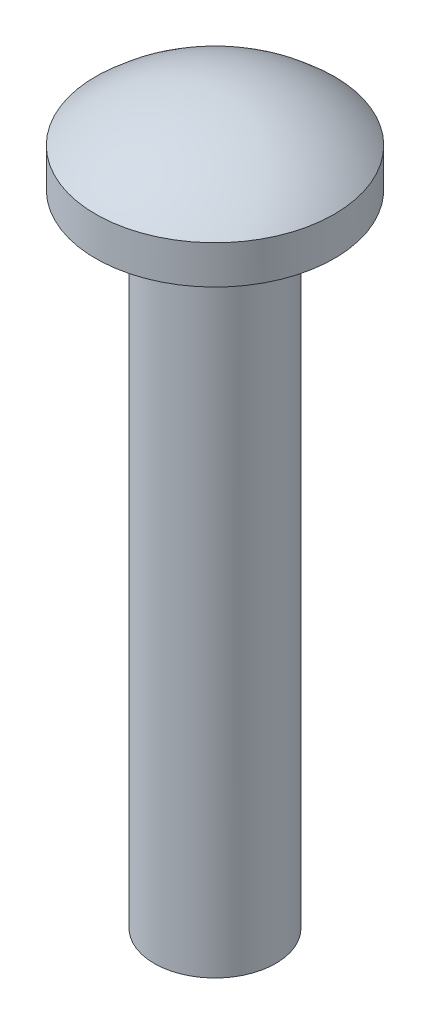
from build123d import *

# Parameters (mm, degrees)
SKETCH2_R           = 2.413
BOSS_EXTRUDE1_DEPTH = 25.4


with BuildPart() as part:
    # Sketch1 → Revolve1 (revolve)
    with BuildSketch(Plane.XY):
        with BuildLine():
            Line((0, 0), (0, 3.3782))
            ThreePointArc((0, 3.3782), (2.543529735, 2.898137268), (4.7371, 1.524))
            Line((4.7371, 1.524), (4.7371, 0))
            Line((4.7371, 0), (0, 0))
        make_face()
    revolve(axis=Axis((0, 0, 0), (0, 1, 0)))

    # Sketch2 → Boss-Extrude1 (add)
    with BuildSketch(Plane(origin=(0, 0, 0), x_dir=(1, 0, 0), z_dir=(0, 1, 0))):
        with Locations(Location((0, 0, 0), (0, 0, 270))):
            Circle(SKETCH2_R)
    extrude(amount=-BOSS_EXTRUDE1_DEPTH)


solid = part.part
